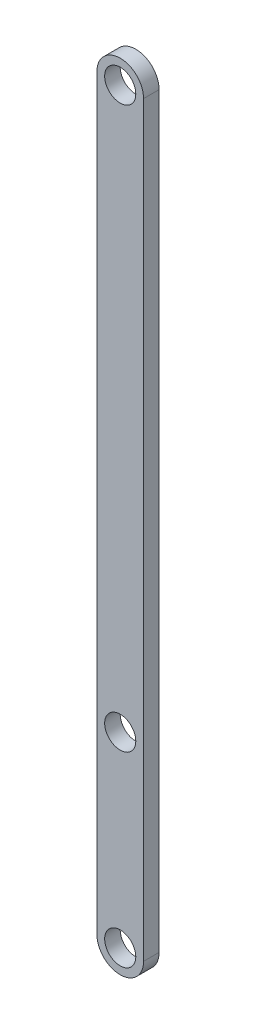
ISO-10303-21;
HEADER;
FILE_DESCRIPTION(('STEP AP214'),'2;1');
FILE_NAME('part.step','',(''),(''),'','','');
FILE_SCHEMA(('AUTOMOTIVE_DESIGN { 1 0 10303 214 1 1 1 1 }'));
ENDSEC;
DATA;
#1=APPLICATION_CONTEXT('core data for automotive mechanical design processes');
#2=APPLICATION_PROTOCOL_DEFINITION('international standard','automotive_design',2000,#1);
#3=PRODUCT_CONTEXT('',#1,'mechanical');
#4=PRODUCT('Part','Part','',(#3));
#5=PRODUCT_RELATED_PRODUCT_CATEGORY('part','',(#4));
#6=PRODUCT_DEFINITION_FORMATION('','',#4);
#7=PRODUCT_DEFINITION_CONTEXT('part definition',#1,'design');
#8=PRODUCT_DEFINITION('design','',#6,#7);
#9=PRODUCT_DEFINITION_SHAPE('','',#8);
#10=(LENGTH_UNIT() NAMED_UNIT(*) SI_UNIT(.MILLI.,.METRE.));
#11=(NAMED_UNIT(*) PLANE_ANGLE_UNIT() SI_UNIT($,.RADIAN.));
#12=(NAMED_UNIT(*) SI_UNIT($,.STERADIAN.) SOLID_ANGLE_UNIT());
#13=UNCERTAINTY_MEASURE_WITH_UNIT(LENGTH_MEASURE(1.E-05),#10,'distance_accuracy_value','');
#14=(GEOMETRIC_REPRESENTATION_CONTEXT(3) GLOBAL_UNCERTAINTY_ASSIGNED_CONTEXT((#13)) GLOBAL_UNIT_ASSIGNED_CONTEXT((#10,
#11,#12)) REPRESENTATION_CONTEXT('',''));
#15=CARTESIAN_POINT('',(0.,0.,0.));
#16=DIRECTION('',(0.,0.,1.));
#17=DIRECTION('',(1.,0.,0.));
#18=AXIS2_PLACEMENT_3D('',#15,#16,#17);
#19=CARTESIAN_POINT('',(0.,240.,5.));
#20=DIRECTION('',(0.,0.,1.));
#21=DIRECTION('',(1.,0.,0.));
#22=AXIS2_PLACEMENT_3D('',#19,#20,#21);
#23=PLANE('',#22);
#24=CARTESIAN_POINT('',(0.,60.,5.));
#25=DIRECTION('',(0.,0.,1.));
#26=DIRECTION('',(1.,0.,0.));
#27=AXIS2_PLACEMENT_3D('',#24,#25,#26);
#28=CIRCLE('',#27,5.);
#29=CARTESIAN_POINT('',(5.,60.,5.));
#30=VERTEX_POINT('',#29);
#31=EDGE_CURVE('E139',#30,#30,#28,.T.);
#32=ORIENTED_EDGE('',*,*,#31,.F.);
#33=EDGE_LOOP('',(#32));
#34=FACE_BOUND('',#33,.T.);
#35=CARTESIAN_POINT('',(0.,240.,5.));
#36=DIRECTION('',(0.,0.,1.));
#37=DIRECTION('',(1.,0.,0.));
#38=AXIS2_PLACEMENT_3D('',#35,#36,#37);
#39=CIRCLE('',#38,7.5);
#40=CARTESIAN_POINT('',(7.5,240.,5.));
#41=VERTEX_POINT('',#40);
#42=CARTESIAN_POINT('',(-7.5,240.,5.));
#43=VERTEX_POINT('',#42);
#44=EDGE_CURVE('E109',#41,#43,#39,.T.);
#45=ORIENTED_EDGE('',*,*,#44,.T.);
#46=DIRECTION('',(0.,-1.,0.));
#47=VECTOR('',#46,1.);
#48=CARTESIAN_POINT('',(-7.5,240.,5.));
#49=LINE('',#48,#47);
#50=CARTESIAN_POINT('',(-7.5,0.,5.));
#51=VERTEX_POINT('',#50);
#52=EDGE_CURVE('E90',#43,#51,#49,.T.);
#53=ORIENTED_EDGE('',*,*,#52,.T.);
#54=CARTESIAN_POINT('',(0.,0.,5.));
#55=DIRECTION('',(0.,0.,1.));
#56=DIRECTION('',(1.,0.,0.));
#57=AXIS2_PLACEMENT_3D('',#54,#55,#56);
#58=CIRCLE('',#57,7.5);
#59=CARTESIAN_POINT('',(7.5,0.,5.));
#60=VERTEX_POINT('',#59);
#61=EDGE_CURVE('E55',#51,#60,#58,.T.);
#62=ORIENTED_EDGE('',*,*,#61,.T.);
#63=DIRECTION('',(0.,1.,0.));
#64=VECTOR('',#63,1.);
#65=CARTESIAN_POINT('',(7.5,0.,5.));
#66=LINE('',#65,#64);
#67=EDGE_CURVE('E50',#60,#41,#66,.T.);
#68=ORIENTED_EDGE('',*,*,#67,.T.);
#69=EDGE_LOOP('',(#45,#53,#62,#68));
#70=FACE_BOUND('',#69,.T.);
#71=CARTESIAN_POINT('',(0.,0.,5.));
#72=DIRECTION('',(0.,0.,1.));
#73=DIRECTION('',(1.,0.,0.));
#74=AXIS2_PLACEMENT_3D('',#71,#72,#73);
#75=CIRCLE('',#74,5.);
#76=CARTESIAN_POINT('',(5.,0.,5.));
#77=VERTEX_POINT('',#76);
#78=EDGE_CURVE('E96',#77,#77,#75,.T.);
#79=ORIENTED_EDGE('',*,*,#78,.F.);
#80=EDGE_LOOP('',(#79));
#81=FACE_BOUND('',#80,.T.);
#82=CARTESIAN_POINT('',(0.,240.,5.));
#83=DIRECTION('',(0.,0.,1.));
#84=DIRECTION('',(1.,0.,0.));
#85=AXIS2_PLACEMENT_3D('',#82,#83,#84);
#86=CIRCLE('',#85,5.);
#87=CARTESIAN_POINT('',(5.,240.,5.));
#88=VERTEX_POINT('',#87);
#89=EDGE_CURVE('E130',#88,#88,#86,.T.);
#90=ORIENTED_EDGE('',*,*,#89,.F.);
#91=EDGE_LOOP('',(#90));
#92=FACE_BOUND('',#91,.T.);
#93=ADVANCED_FACE('F35',(#34,#70,#81,#92),#23,.T.);
#94=CARTESIAN_POINT('',(0.,240.,0.));
#95=DIRECTION('',(0.,0.,1.));
#96=DIRECTION('',(1.,0.,0.));
#97=AXIS2_PLACEMENT_3D('',#94,#95,#96);
#98=PLANE('',#97);
#99=CARTESIAN_POINT('',(0.,60.,0.));
#100=DIRECTION('',(0.,0.,1.));
#101=DIRECTION('',(1.,0.,0.));
#102=AXIS2_PLACEMENT_3D('',#99,#100,#101);
#103=CIRCLE('',#102,5.);
#104=CARTESIAN_POINT('',(5.,60.,0.));
#105=VERTEX_POINT('',#104);
#106=EDGE_CURVE('E133',#105,#105,#103,.T.);
#107=ORIENTED_EDGE('',*,*,#106,.T.);
#108=EDGE_LOOP('',(#107));
#109=FACE_BOUND('',#108,.T.);
#110=CARTESIAN_POINT('',(0.,240.,0.));
#111=DIRECTION('',(0.,0.,1.));
#112=DIRECTION('',(1.,0.,0.));
#113=AXIS2_PLACEMENT_3D('',#110,#111,#112);
#114=CIRCLE('',#113,7.5);
#115=CARTESIAN_POINT('',(7.5,240.,0.));
#116=VERTEX_POINT('',#115);
#117=CARTESIAN_POINT('',(-7.5,240.,0.));
#118=VERTEX_POINT('',#117);
#119=EDGE_CURVE('E81',#116,#118,#114,.T.);
#120=ORIENTED_EDGE('',*,*,#119,.F.);
#121=DIRECTION('',(0.,1.,0.));
#122=VECTOR('',#121,1.);
#123=CARTESIAN_POINT('',(7.5,0.,0.));
#124=LINE('',#123,#122);
#125=CARTESIAN_POINT('',(7.5,0.,0.));
#126=VERTEX_POINT('',#125);
#127=EDGE_CURVE('E107',#126,#116,#124,.T.);
#128=ORIENTED_EDGE('',*,*,#127,.F.);
#129=CARTESIAN_POINT('',(0.,0.,0.));
#130=DIRECTION('',(0.,0.,1.));
#131=DIRECTION('',(1.,0.,0.));
#132=AXIS2_PLACEMENT_3D('',#129,#130,#131);
#133=CIRCLE('',#132,7.5);
#134=CARTESIAN_POINT('',(-7.5,0.,0.));
#135=VERTEX_POINT('',#134);
#136=EDGE_CURVE('E82',#135,#126,#133,.T.);
#137=ORIENTED_EDGE('',*,*,#136,.F.);
#138=DIRECTION('',(0.,-1.,0.));
#139=VECTOR('',#138,1.);
#140=CARTESIAN_POINT('',(-7.5,240.,0.));
#141=LINE('',#140,#139);
#142=EDGE_CURVE('E76',#118,#135,#141,.T.);
#143=ORIENTED_EDGE('',*,*,#142,.F.);
#144=EDGE_LOOP('',(#120,#128,#137,#143));
#145=FACE_BOUND('',#144,.T.);
#146=CARTESIAN_POINT('',(0.,0.,0.));
#147=DIRECTION('',(0.,0.,1.));
#148=DIRECTION('',(1.,0.,0.));
#149=AXIS2_PLACEMENT_3D('',#146,#147,#148);
#150=CIRCLE('',#149,5.);
#151=CARTESIAN_POINT('',(5.,0.,0.));
#152=VERTEX_POINT('',#151);
#153=EDGE_CURVE('E102',#152,#152,#150,.T.);
#154=ORIENTED_EDGE('',*,*,#153,.T.);
#155=EDGE_LOOP('',(#154));
#156=FACE_BOUND('',#155,.T.);
#157=CARTESIAN_POINT('',(0.,240.,0.));
#158=DIRECTION('',(0.,0.,1.));
#159=DIRECTION('',(1.,0.,0.));
#160=AXIS2_PLACEMENT_3D('',#157,#158,#159);
#161=CIRCLE('',#160,5.);
#162=CARTESIAN_POINT('',(5.,240.,0.));
#163=VERTEX_POINT('',#162);
#164=EDGE_CURVE('E134',#163,#163,#161,.T.);
#165=ORIENTED_EDGE('',*,*,#164,.T.);
#166=EDGE_LOOP('',(#165));
#167=FACE_BOUND('',#166,.T.);
#168=ADVANCED_FACE('F77',(#109,#145,#156,#167),#98,.F.);
#169=CARTESIAN_POINT('',(0.,240.,5.));
#170=DIRECTION('',(0.,0.,-1.));
#171=DIRECTION('',(-1.,0.,0.));
#172=AXIS2_PLACEMENT_3D('',#169,#170,#171);
#173=CYLINDRICAL_SURFACE('',#172,7.5);
#174=ORIENTED_EDGE('',*,*,#119,.T.);
#175=DIRECTION('',(0.,0.,-1.));
#176=VECTOR('',#175,1.);
#177=CARTESIAN_POINT('',(-7.5,240.,5.));
#178=LINE('',#177,#176);
#179=EDGE_CURVE('E11',#43,#118,#178,.T.);
#180=ORIENTED_EDGE('',*,*,#179,.F.);
#181=ORIENTED_EDGE('',*,*,#44,.F.);
#182=DIRECTION('',(0.,0.,-1.));
#183=VECTOR('',#182,1.);
#184=CARTESIAN_POINT('',(7.5,240.,5.));
#185=LINE('',#184,#183);
#186=EDGE_CURVE('E94',#41,#116,#185,.T.);
#187=ORIENTED_EDGE('',*,*,#186,.T.);
#188=EDGE_LOOP('',(#174,#180,#181,#187));
#189=FACE_BOUND('',#188,.T.);
#190=ADVANCED_FACE('F37',(#189),#173,.T.);
#191=CARTESIAN_POINT('',(-7.5,240.,5.));
#192=DIRECTION('',(1.,0.,0.));
#193=DIRECTION('',(0.,1.,0.));
#194=AXIS2_PLACEMENT_3D('',#191,#192,#193);
#195=PLANE('',#194);
#196=ORIENTED_EDGE('',*,*,#142,.T.);
#197=DIRECTION('',(0.,0.,-1.));
#198=VECTOR('',#197,1.);
#199=CARTESIAN_POINT('',(-7.5,0.,5.));
#200=LINE('',#199,#198);
#201=EDGE_CURVE('E43',#51,#135,#200,.T.);
#202=ORIENTED_EDGE('',*,*,#201,.F.);
#203=ORIENTED_EDGE('',*,*,#52,.F.);
#204=ORIENTED_EDGE('',*,*,#179,.T.);
#205=EDGE_LOOP('',(#196,#202,#203,#204));
#206=FACE_BOUND('',#205,.T.);
#207=ADVANCED_FACE('F89',(#206),#195,.F.);
#208=CARTESIAN_POINT('',(0.,0.,5.));
#209=DIRECTION('',(0.,0.,-1.));
#210=DIRECTION('',(-1.,0.,0.));
#211=AXIS2_PLACEMENT_3D('',#208,#209,#210);
#212=CYLINDRICAL_SURFACE('',#211,7.5);
#213=ORIENTED_EDGE('',*,*,#136,.T.);
#214=DIRECTION('',(0.,0.,-1.));
#215=VECTOR('',#214,1.);
#216=CARTESIAN_POINT('',(7.5,0.,5.));
#217=LINE('',#216,#215);
#218=EDGE_CURVE('E116',#60,#126,#217,.T.);
#219=ORIENTED_EDGE('',*,*,#218,.F.);
#220=ORIENTED_EDGE('',*,*,#61,.F.);
#221=ORIENTED_EDGE('',*,*,#201,.T.);
#222=EDGE_LOOP('',(#213,#219,#220,#221));
#223=FACE_BOUND('',#222,.T.);
#224=ADVANCED_FACE('F119',(#223),#212,.T.);
#225=CARTESIAN_POINT('',(7.5,0.,5.));
#226=DIRECTION('',(-1.,0.,0.));
#227=DIRECTION('',(0.,-1.,0.));
#228=AXIS2_PLACEMENT_3D('',#225,#226,#227);
#229=PLANE('',#228);
#230=ORIENTED_EDGE('',*,*,#127,.T.);
#231=ORIENTED_EDGE('',*,*,#186,.F.);
#232=ORIENTED_EDGE('',*,*,#67,.F.);
#233=ORIENTED_EDGE('',*,*,#218,.T.);
#234=EDGE_LOOP('',(#230,#231,#232,#233));
#235=FACE_BOUND('',#234,.T.);
#236=ADVANCED_FACE('F121',(#235),#229,.F.);
#237=CARTESIAN_POINT('',(0.,0.,5.));
#238=DIRECTION('',(0.,0.,-1.));
#239=DIRECTION('',(-1.,0.,0.));
#240=AXIS2_PLACEMENT_3D('',#237,#238,#239);
#241=CYLINDRICAL_SURFACE('',#240,5.);
#242=ORIENTED_EDGE('',*,*,#78,.T.);
#243=EDGE_LOOP('',(#242));
#244=FACE_BOUND('',#243,.T.);
#245=ORIENTED_EDGE('',*,*,#153,.F.);
#246=EDGE_LOOP('',(#245));
#247=FACE_BOUND('',#246,.T.);
#248=ADVANCED_FACE('F149',(#244,#247),#241,.F.);
#249=CARTESIAN_POINT('',(0.,60.,5.));
#250=DIRECTION('',(0.,0.,-1.));
#251=DIRECTION('',(-1.,0.,0.));
#252=AXIS2_PLACEMENT_3D('',#249,#250,#251);
#253=CYLINDRICAL_SURFACE('',#252,5.);
#254=ORIENTED_EDGE('',*,*,#31,.T.);
#255=EDGE_LOOP('',(#254));
#256=FACE_BOUND('',#255,.T.);
#257=ORIENTED_EDGE('',*,*,#106,.F.);
#258=EDGE_LOOP('',(#257));
#259=FACE_BOUND('',#258,.T.);
#260=ADVANCED_FACE('F151',(#256,#259),#253,.F.);
#261=CARTESIAN_POINT('',(0.,240.,5.));
#262=DIRECTION('',(0.,0.,-1.));
#263=DIRECTION('',(-1.,0.,0.));
#264=AXIS2_PLACEMENT_3D('',#261,#262,#263);
#265=CYLINDRICAL_SURFACE('',#264,5.);
#266=ORIENTED_EDGE('',*,*,#89,.T.);
#267=EDGE_LOOP('',(#266));
#268=FACE_BOUND('',#267,.T.);
#269=ORIENTED_EDGE('',*,*,#164,.F.);
#270=EDGE_LOOP('',(#269));
#271=FACE_BOUND('',#270,.T.);
#272=ADVANCED_FACE('F157',(#268,#271),#265,.F.);
#273=CLOSED_SHELL('',(#93,#168,#190,#207,#224,#236,#248,#260,#272));
#274=MANIFOLD_SOLID_BREP('B2',#273);
#275=ADVANCED_BREP_SHAPE_REPRESENTATION('',(#18,#274),#14);
#276=SHAPE_DEFINITION_REPRESENTATION(#9,#275);
ENDSEC;
END-ISO-10303-21;
